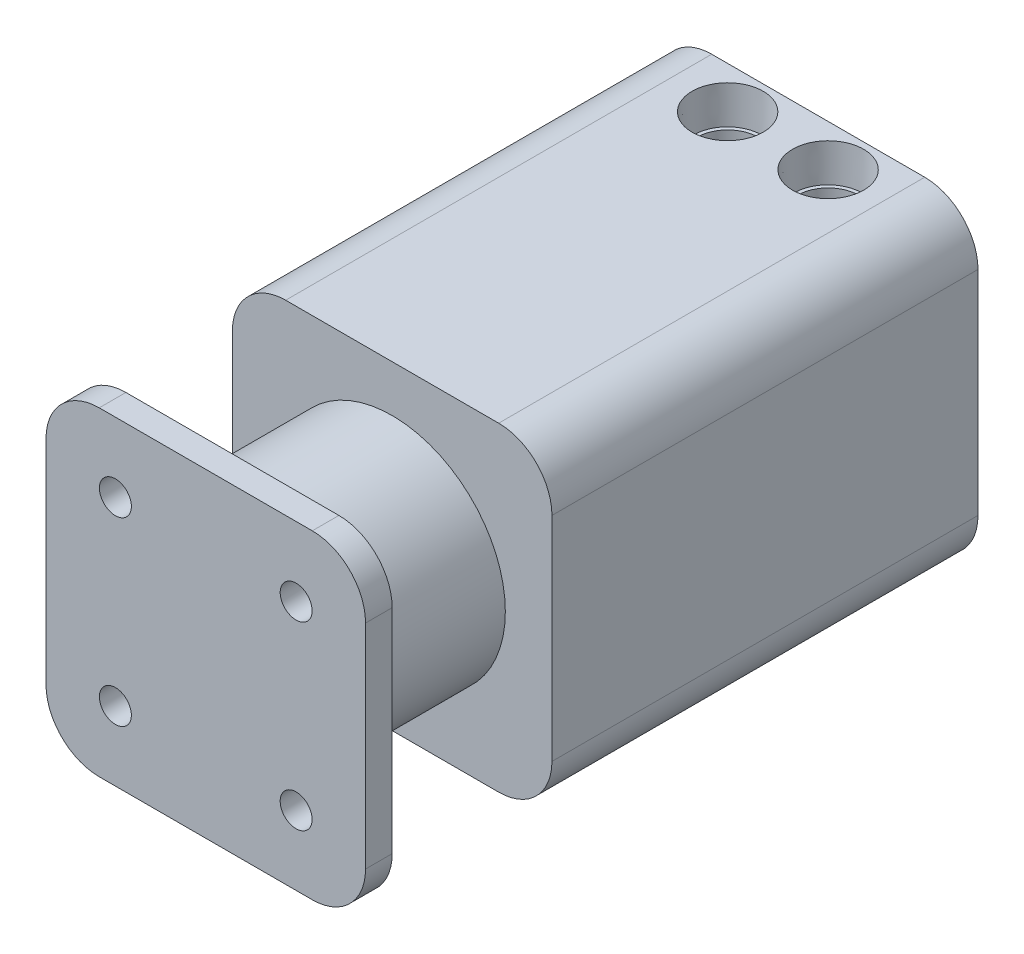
from build123d import *

# Parameters (mm, degrees)
SKETCH_1_W               = 120
SKETCH_1_H               = 120
EXTRUDE_1_DEPTH          = 230
SKETCH_2_W               = 120
SKETCH_2_H               = 120
SKETCH_2_R               = 42.5
CUT_EXTRUDE_1_DEPTH      = 60
FILLET_1_R               = 20
SKETCH_3_R               = 6
CUT_EXTRUDE_2_DEPTH      = 20
F_3_4_NPT_1_AT_2_COUNT   = 2
F_3_4_NPT_1_AT_2_PITCH   = 37.719895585
PATTERN_CIRCULAR_1_COUNT = 4


with BuildPart() as part:
    # Sketch 1 → Extrude 1 (new body)
    with BuildSketch(Plane.XY):
        Rectangle(SKETCH_1_W, SKETCH_1_H)
    extrude(amount=EXTRUDE_1_DEPTH)

    # Sketch 2 → Cut-Extrude 1 (cut)
    with BuildSketch(Plane.XY.offset(220)):
        Rectangle(SKETCH_2_W, SKETCH_2_H)
        Circle(SKETCH_2_R, mode=Mode.SUBTRACT)
    extrude(amount=-CUT_EXTRUDE_1_DEPTH, mode=Mode.SUBTRACT)

    # Fillet 1
    fillet_1_edges = [part.edges().sort_by_distance(p)[0] for p in [
        (-60, 60, 80),
        (60, 60, 80),
        (60, -60, 80),
        (-60, -60, 80),
        (-60, 60, 225),
        (60, 60, 225),
        (60, -60, 225),
        (-60, -60, 225),
    ]]
    fillet(fillet_1_edges, radius=FILLET_1_R)

    # Sketch 3 → Cut-Extrude 2 (cut)
    with BuildSketch(Plane.XY.offset(230)):
        with Locations((-33.941125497, 33.941125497)):
            Circle(SKETCH_3_R)
    cut_extrude_2 = extrude(amount=-CUT_EXTRUDE_2_DEPTH, mode=Mode.SUBTRACT)

    # Sketch 4 → 3_4 NPT _1 (revolve, cut)
    with BuildSketch(Plane(origin=(-18.305243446, 60, 15.707921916), x_dir=(0, 0, 1), z_dir=(1, 0, 0))):
        Polygon((0, 0), (0, 30.033622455), (11.5062, 23.12), (11.5062, 14.05), (12.914209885, 14.05), (13.3348857, 0), align=None)
    f_3_4_npt_1 = revolve(axis=Axis((-18.305243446, 66.35, 15.707921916), (0, -1, 0)), mode=Mode.SUBTRACT)

    # 3_4 NPT _1 at 2: 3_4 NPT _1 ×2
    with Locations(*[(i * F_3_4_NPT_1_AT_2_PITCH, 0, 0) for i in range(1, F_3_4_NPT_1_AT_2_COUNT)]):
        add(f_3_4_npt_1, mode=Mode.SUBTRACT)

    # Pattern Circular 1: Cut-Extrude 2 ×4 about axis
    pattern_circular_1_axis = Axis((0, 0, 0), (0, 0, 1))
    for i in range(1, PATTERN_CIRCULAR_1_COUNT):
        add(cut_extrude_2.rotate(pattern_circular_1_axis, i * 360 / PATTERN_CIRCULAR_1_COUNT), mode=Mode.SUBTRACT)


solid = part.part
